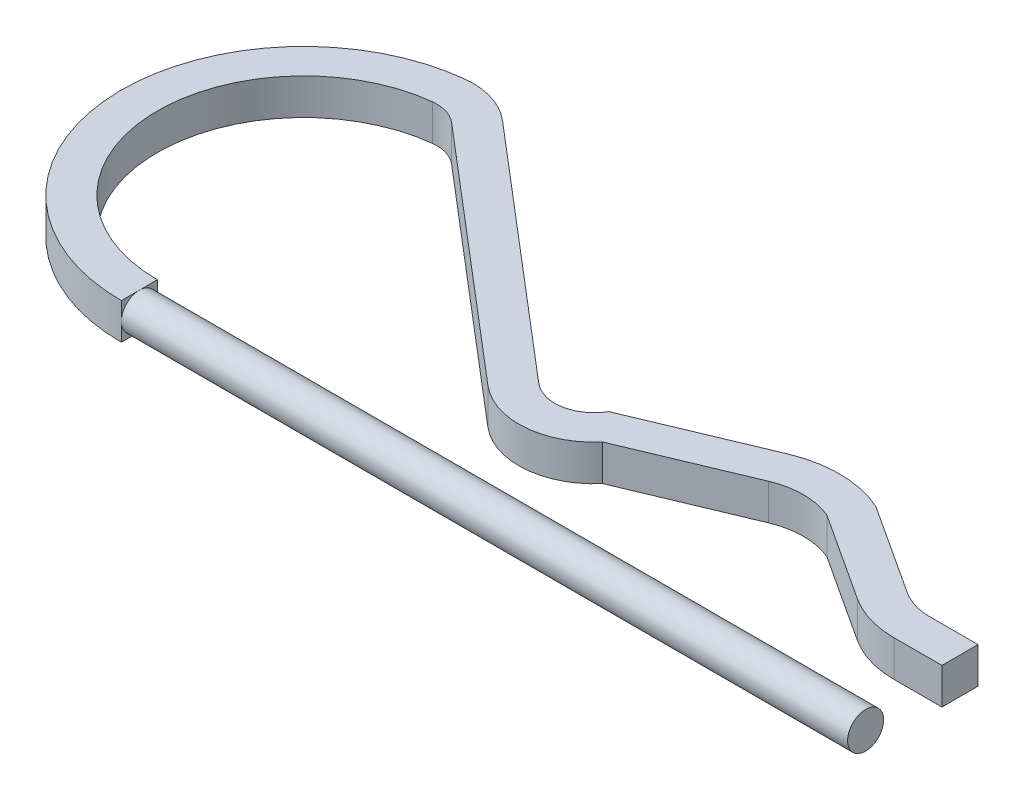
ISO-10303-21;
HEADER;
FILE_DESCRIPTION(('STEP AP214'),'2;1');
FILE_NAME('part.step','',(''),(''),'','','');
FILE_SCHEMA(('AUTOMOTIVE_DESIGN { 1 0 10303 214 1 1 1 1 }'));
ENDSEC;
DATA;
#1=APPLICATION_CONTEXT('core data for automotive mechanical design processes');
#2=APPLICATION_PROTOCOL_DEFINITION('international standard','automotive_design',2000,#1);
#3=PRODUCT_CONTEXT('',#1,'mechanical');
#4=PRODUCT('Part','Part','',(#3));
#5=PRODUCT_RELATED_PRODUCT_CATEGORY('part','',(#4));
#6=PRODUCT_DEFINITION_FORMATION('','',#4);
#7=PRODUCT_DEFINITION_CONTEXT('part definition',#1,'design');
#8=PRODUCT_DEFINITION('design','',#6,#7);
#9=PRODUCT_DEFINITION_SHAPE('','',#8);
#10=(LENGTH_UNIT() NAMED_UNIT(*) SI_UNIT(.MILLI.,.METRE.));
#11=(NAMED_UNIT(*) PLANE_ANGLE_UNIT() SI_UNIT($,.RADIAN.));
#12=(NAMED_UNIT(*) SI_UNIT($,.STERADIAN.) SOLID_ANGLE_UNIT());
#13=UNCERTAINTY_MEASURE_WITH_UNIT(LENGTH_MEASURE(1.E-05),#10,'distance_accuracy_value','');
#14=(GEOMETRIC_REPRESENTATION_CONTEXT(3) GLOBAL_UNCERTAINTY_ASSIGNED_CONTEXT((#13)) GLOBAL_UNIT_ASSIGNED_CONTEXT((#10,
#11,#12)) REPRESENTATION_CONTEXT('',''));
#15=CARTESIAN_POINT('',(0.,0.,0.));
#16=DIRECTION('',(0.,0.,1.));
#17=DIRECTION('',(1.,0.,0.));
#18=AXIS2_PLACEMENT_3D('',#15,#16,#17);
#19=CARTESIAN_POINT('',(-51.1436781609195,2.54,2.54));
#20=DIRECTION('',(-1.,0.,0.));
#21=DIRECTION('',(0.,0.,1.));
#22=AXIS2_PLACEMENT_3D('',#19,#20,#21);
#23=PLANE('',#22);
#24=CARTESIAN_POINT('',(-51.1436781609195,1.27,1.27));
#25=DIRECTION('',(1.,0.,0.));
#26=DIRECTION('',(0.,0.,-1.));
#27=AXIS2_PLACEMENT_3D('',#24,#25,#26);
#28=CIRCLE('',#27,1.27);
#29=CARTESIAN_POINT('',(-51.1436781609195,1.27,2.54));
#30=VERTEX_POINT('',#29);
#31=CARTESIAN_POINT('',(-51.1436781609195,0.,1.27));
#32=VERTEX_POINT('',#31);
#33=EDGE_CURVE('E201',#30,#32,#28,.T.);
#34=ORIENTED_EDGE('',*,*,#33,.F.);
#35=DIRECTION('',(0.,-1.,0.));
#36=VECTOR('',#35,1.);
#37=CARTESIAN_POINT('',(-51.1436781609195,2.54,2.54));
#38=LINE('',#37,#36);
#39=CARTESIAN_POINT('',(-51.1436781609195,0.,2.54));
#40=VERTEX_POINT('',#39);
#41=EDGE_CURVE('E188',#30,#40,#38,.T.);
#42=ORIENTED_EDGE('',*,*,#41,.T.);
#43=DIRECTION('',(0.,0.,-1.));
#44=VECTOR('',#43,1.);
#45=CARTESIAN_POINT('',(-51.1436781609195,0.,2.54));
#46=LINE('',#45,#44);
#47=EDGE_CURVE('E202',#40,#32,#46,.T.);
#48=ORIENTED_EDGE('',*,*,#47,.T.);
#49=EDGE_LOOP('',(#34,#42,#48));
#50=FACE_BOUND('',#49,.T.);
#51=ADVANCED_FACE('F31',(#50),#23,.F.);
#52=CARTESIAN_POINT('',(-51.1436781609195,1.27,0.));
#53=VERTEX_POINT('',#52);
#54=EDGE_CURVE('E205',#32,#53,#28,.T.);
#55=ORIENTED_EDGE('',*,*,#54,.F.);
#56=CARTESIAN_POINT('',(-51.1436781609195,0.,0.));
#57=VERTEX_POINT('',#56);
#58=EDGE_CURVE('E291',#32,#57,#46,.T.);
#59=ORIENTED_EDGE('',*,*,#58,.T.);
#60=DIRECTION('',(0.,-1.,0.));
#61=VECTOR('',#60,1.);
#62=CARTESIAN_POINT('',(-51.1436781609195,2.54,0.));
#63=LINE('',#62,#61);
#64=EDGE_CURVE('E252',#53,#57,#63,.T.);
#65=ORIENTED_EDGE('',*,*,#64,.F.);
#66=EDGE_LOOP('',(#55,#59,#65));
#67=FACE_BOUND('',#66,.T.);
#68=ADVANCED_FACE('F373',(#67),#23,.F.);
#69=CARTESIAN_POINT('',(-51.1436781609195,2.54,1.27));
#70=VERTEX_POINT('',#69);
#71=EDGE_CURVE('E46',#53,#70,#28,.T.);
#72=ORIENTED_EDGE('',*,*,#71,.F.);
#73=CARTESIAN_POINT('',(-51.1436781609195,2.54,0.));
#74=VERTEX_POINT('',#73);
#75=EDGE_CURVE('E199',#74,#53,#63,.T.);
#76=ORIENTED_EDGE('',*,*,#75,.F.);
#77=DIRECTION('',(0.,0.,-1.));
#78=VECTOR('',#77,1.);
#79=CARTESIAN_POINT('',(-51.1436781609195,2.54,2.54));
#80=LINE('',#79,#78);
#81=EDGE_CURVE('E250',#70,#74,#80,.T.);
#82=ORIENTED_EDGE('',*,*,#81,.F.);
#83=EDGE_LOOP('',(#72,#76,#82));
#84=FACE_BOUND('',#83,.T.);
#85=ADVANCED_FACE('F374',(#84),#23,.F.);
#86=EDGE_CURVE('E54',#70,#30,#28,.T.);
#87=ORIENTED_EDGE('',*,*,#86,.F.);
#88=CARTESIAN_POINT('',(-51.1436781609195,2.54,2.54));
#89=VERTEX_POINT('',#88);
#90=EDGE_CURVE('E184',#89,#70,#80,.T.);
#91=ORIENTED_EDGE('',*,*,#90,.F.);
#92=EDGE_CURVE('E180',#89,#30,#38,.T.);
#93=ORIENTED_EDGE('',*,*,#92,.T.);
#94=EDGE_LOOP('',(#87,#91,#93));
#95=FACE_BOUND('',#94,.T.);
#96=ADVANCED_FACE('F182',(#95),#23,.F.);
#97=CARTESIAN_POINT('',(-51.1436781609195,2.54,-10.3028569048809));
#98=DIRECTION('',(0.,-1.,0.));
#99=DIRECTION('',(0.,0.,-1.));
#100=AXIS2_PLACEMENT_3D('',#97,#98,#99);
#101=CYLINDRICAL_SURFACE('',#100,10.3028569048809);
#102=CARTESIAN_POINT('',(-51.1436781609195,0.,-10.3028569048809));
#103=DIRECTION('',(0.,-1.,0.));
#104=DIRECTION('',(0.,0.,-1.));
#105=AXIS2_PLACEMENT_3D('',#102,#103,#104);
#106=CIRCLE('',#105,10.3028569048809);
#107=CARTESIAN_POINT('',(-52.3081024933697,0.,-20.5397009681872));
#108=VERTEX_POINT('',#107);
#109=EDGE_CURVE('E253',#57,#108,#106,.T.);
#110=ORIENTED_EDGE('',*,*,#109,.T.);
#111=DIRECTION('',(0.,-1.,0.));
#112=VECTOR('',#111,1.);
#113=CARTESIAN_POINT('',(-52.3081024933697,2.54,-20.5397009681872));
#114=LINE('',#113,#112);
#115=CARTESIAN_POINT('',(-52.3081024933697,2.54,-20.5397009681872));
#116=VERTEX_POINT('',#115);
#117=EDGE_CURVE('E11',#116,#108,#114,.T.);
#118=ORIENTED_EDGE('',*,*,#117,.F.);
#119=CARTESIAN_POINT('',(-51.1436781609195,2.54,-10.3028569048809));
#120=DIRECTION('',(0.,-1.,0.));
#121=DIRECTION('',(0.,0.,-1.));
#122=AXIS2_PLACEMENT_3D('',#119,#120,#121);
#123=CIRCLE('',#122,10.3028569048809);
#124=EDGE_CURVE('E211',#74,#116,#123,.T.);
#125=ORIENTED_EDGE('',*,*,#124,.F.);
#126=ORIENTED_EDGE('',*,*,#75,.T.);
#127=ORIENTED_EDGE('',*,*,#64,.T.);
#128=EDGE_LOOP('',(#110,#118,#125,#126,#127));
#129=FACE_BOUND('',#128,.T.);
#130=ADVANCED_FACE('F33',(#129),#101,.F.);
#131=CARTESIAN_POINT('',(-52.0210328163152,2.54,-18.0159753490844));
#132=DIRECTION('',(0.,-1.,0.));
#133=DIRECTION('',(0.,0.,-1.));
#134=AXIS2_PLACEMENT_3D('',#131,#132,#133);
#135=CYLINDRICAL_SURFACE('',#134,2.54000000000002);
#136=CARTESIAN_POINT('',(-52.0210328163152,0.,-18.0159753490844));
#137=DIRECTION('',(0.,-1.,0.));
#138=DIRECTION('',(0.,0.,-1.));
#139=AXIS2_PLACEMENT_3D('',#136,#137,#138);
#140=CIRCLE('',#139,2.54000000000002);
#141=CARTESIAN_POINT('',(-50.3732480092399,0.,-19.9489536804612));
#142=VERTEX_POINT('',#141);
#143=EDGE_CURVE('E256',#108,#142,#140,.T.);
#144=ORIENTED_EDGE('',*,*,#143,.T.);
#145=DIRECTION('',(0.,-1.,0.));
#146=VECTOR('',#145,1.);
#147=CARTESIAN_POINT('',(-50.3732480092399,2.54,-19.9489536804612));
#148=LINE('',#147,#146);
#149=CARTESIAN_POINT('',(-50.3732480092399,2.54,-19.9489536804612));
#150=VERTEX_POINT('',#149);
#151=EDGE_CURVE('E39',#150,#142,#148,.T.);
#152=ORIENTED_EDGE('',*,*,#151,.F.);
#153=CARTESIAN_POINT('',(-52.0210328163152,2.54,-18.0159753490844));
#154=DIRECTION('',(0.,-1.,0.));
#155=DIRECTION('',(0.,0.,-1.));
#156=AXIS2_PLACEMENT_3D('',#153,#154,#155);
#157=CIRCLE('',#156,2.54000000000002);
#158=EDGE_CURVE('E214',#116,#150,#157,.T.);
#159=ORIENTED_EDGE('',*,*,#158,.F.);
#160=ORIENTED_EDGE('',*,*,#117,.T.);
#161=EDGE_LOOP('',(#144,#152,#159,#160));
#162=FACE_BOUND('',#161,.T.);
#163=ADVANCED_FACE('F368',(#162),#135,.F.);
#164=CARTESIAN_POINT('',(-50.3732480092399,2.54,-19.9489536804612));
#165=DIRECTION('',(0.648734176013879,0.,-0.761015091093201));
#166=DIRECTION('',(-0.761015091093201,0.,-0.648734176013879));
#167=AXIS2_PLACEMENT_3D('',#164,#165,#166);
#168=PLANE('',#167);
#169=DIRECTION('',(0.761015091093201,0.,0.648734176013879));
#170=VECTOR('',#169,1.);
#171=CARTESIAN_POINT('',(-50.3732480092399,0.,-19.9489536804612));
#172=LINE('',#171,#170);
#173=CARTESIAN_POINT('',(-33.0580876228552,0.,-5.18848908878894));
#174=VERTEX_POINT('',#173);
#175=EDGE_CURVE('E258',#142,#174,#172,.T.);
#176=ORIENTED_EDGE('',*,*,#175,.T.);
#177=DIRECTION('',(0.,-1.,0.));
#178=VECTOR('',#177,1.);
#179=CARTESIAN_POINT('',(-33.0580876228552,2.54,-5.18848908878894));
#180=LINE('',#179,#178);
#181=CARTESIAN_POINT('',(-33.0580876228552,2.54,-5.18848908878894));
#182=VERTEX_POINT('',#181);
#183=EDGE_CURVE('E338',#182,#174,#180,.T.);
#184=ORIENTED_EDGE('',*,*,#183,.F.);
#185=DIRECTION('',(0.761015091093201,0.,0.648734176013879));
#186=VECTOR('',#185,1.);
#187=CARTESIAN_POINT('',(-50.3732480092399,2.54,-19.9489536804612));
#188=LINE('',#187,#186);
#189=EDGE_CURVE('E216',#150,#182,#188,.T.);
#190=ORIENTED_EDGE('',*,*,#189,.F.);
#191=ORIENTED_EDGE('',*,*,#151,.T.);
#192=EDGE_LOOP('',(#176,#184,#190,#191));
#193=FACE_BOUND('',#192,.T.);
#194=ADVANCED_FACE('F345',(#193),#168,.F.);
#195=CARTESIAN_POINT('',(-29.6130882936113,2.54,-9.22973830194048));
#196=DIRECTION('',(0.,-1.,0.));
#197=DIRECTION('',(0.,0.,-1.));
#198=AXIS2_PLACEMENT_3D('',#195,#196,#197);
#199=CYLINDRICAL_SURFACE('',#198,5.31034043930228);
#200=CARTESIAN_POINT('',(-29.6130882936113,0.,-9.22973830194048));
#201=DIRECTION('',(0.,1.,0.));
#202=DIRECTION('',(0.,0.,1.));
#203=AXIS2_PLACEMENT_3D('',#200,#201,#202);
#204=CIRCLE('',#203,5.31034043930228);
#205=CARTESIAN_POINT('',(-25.5718390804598,0.,-5.78473897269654));
#206=VERTEX_POINT('',#205);
#207=EDGE_CURVE('E260',#174,#206,#204,.T.);
#208=ORIENTED_EDGE('',*,*,#207,.T.);
#209=DIRECTION('',(0.,-1.,0.));
#210=VECTOR('',#209,1.);
#211=CARTESIAN_POINT('',(-25.5718390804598,2.54,-5.78473897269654));
#212=LINE('',#211,#210);
#213=CARTESIAN_POINT('',(-25.5718390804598,2.54,-5.78473897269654));
#214=VERTEX_POINT('',#213);
#215=EDGE_CURVE('E335',#214,#206,#212,.T.);
#216=ORIENTED_EDGE('',*,*,#215,.F.);
#217=CARTESIAN_POINT('',(-29.6130882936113,2.54,-9.22973830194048));
#218=DIRECTION('',(0.,1.,0.));
#219=DIRECTION('',(0.,0.,1.));
#220=AXIS2_PLACEMENT_3D('',#217,#218,#219);
#221=CIRCLE('',#220,5.31034043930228);
#222=EDGE_CURVE('E218',#182,#214,#221,.T.);
#223=ORIENTED_EDGE('',*,*,#222,.F.);
#224=ORIENTED_EDGE('',*,*,#183,.T.);
#225=EDGE_LOOP('',(#208,#216,#223,#224));
#226=FACE_BOUND('',#225,.T.);
#227=ADVANCED_FACE('F356',(#226),#199,.T.);
#228=CARTESIAN_POINT('',(-25.5718390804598,2.54,-5.78473897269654));
#229=DIRECTION('',(-0.386228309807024,0.,-0.922403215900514));
#230=DIRECTION('',(-0.922403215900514,0.,0.386228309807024));
#231=AXIS2_PLACEMENT_3D('',#228,#229,#230);
#232=PLANE('',#231);
#233=DIRECTION('',(0.922403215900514,0.,-0.386228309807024));
#234=VECTOR('',#233,1.);
#235=CARTESIAN_POINT('',(-25.5718390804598,0.,-5.78473897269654));
#236=LINE('',#235,#234);
#237=CARTESIAN_POINT('',(-17.3443778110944,0.,-9.22973830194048));
#238=VERTEX_POINT('',#237);
#239=EDGE_CURVE('E262',#206,#238,#236,.T.);
#240=ORIENTED_EDGE('',*,*,#239,.T.);
#241=DIRECTION('',(0.,-1.,0.));
#242=VECTOR('',#241,1.);
#243=CARTESIAN_POINT('',(-17.3443778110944,2.54,-9.22973830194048));
#244=LINE('',#243,#242);
#245=CARTESIAN_POINT('',(-17.3443778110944,2.54,-9.22973830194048));
#246=VERTEX_POINT('',#245);
#247=EDGE_CURVE('E332',#246,#238,#244,.T.);
#248=ORIENTED_EDGE('',*,*,#247,.F.);
#249=DIRECTION('',(0.922403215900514,0.,-0.386228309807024));
#250=VECTOR('',#249,1.);
#251=CARTESIAN_POINT('',(-25.5718390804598,2.54,-5.78473897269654));
#252=LINE('',#251,#250);
#253=EDGE_CURVE('E220',#214,#246,#252,.T.);
#254=ORIENTED_EDGE('',*,*,#253,.F.);
#255=ORIENTED_EDGE('',*,*,#215,.T.);
#256=EDGE_LOOP('',(#240,#248,#254,#255));
#257=FACE_BOUND('',#256,.T.);
#258=ADVANCED_FACE('F360',(#257),#232,.F.);
#259=CARTESIAN_POINT('',(-15.2877333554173,2.54,-4.31799203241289));
#260=DIRECTION('',(0.,-1.,0.));
#261=DIRECTION('',(0.,0.,-1.));
#262=AXIS2_PLACEMENT_3D('',#259,#260,#261);
#263=CYLINDRICAL_SURFACE('',#262,5.32494486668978);
#264=CARTESIAN_POINT('',(-15.2877333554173,0.,-4.31799203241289));
#265=DIRECTION('',(0.,-1.,0.));
#266=DIRECTION('',(0.,0.,-1.));
#267=AXIS2_PLACEMENT_3D('',#264,#265,#266);
#268=CIRCLE('',#267,5.32494486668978);
#269=CARTESIAN_POINT('',(-13.2310888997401,0.,-9.22973830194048));
#270=VERTEX_POINT('',#269);
#271=EDGE_CURVE('E264',#238,#270,#268,.T.);
#272=ORIENTED_EDGE('',*,*,#271,.T.);
#273=DIRECTION('',(0.,-1.,0.));
#274=VECTOR('',#273,1.);
#275=CARTESIAN_POINT('',(-13.2310888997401,2.54,-9.22973830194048));
#276=LINE('',#275,#274);
#277=CARTESIAN_POINT('',(-13.2310888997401,2.54,-9.22973830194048));
#278=VERTEX_POINT('',#277);
#279=EDGE_CURVE('E329',#278,#270,#276,.T.);
#280=ORIENTED_EDGE('',*,*,#279,.F.);
#281=CARTESIAN_POINT('',(-15.2877333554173,2.54,-4.31799203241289));
#282=DIRECTION('',(0.,-1.,0.));
#283=DIRECTION('',(0.,0.,-1.));
#284=AXIS2_PLACEMENT_3D('',#281,#282,#283);
#285=CIRCLE('',#284,5.32494486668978);
#286=EDGE_CURVE('E222',#246,#278,#285,.T.);
#287=ORIENTED_EDGE('',*,*,#286,.F.);
#288=ORIENTED_EDGE('',*,*,#247,.T.);
#289=EDGE_LOOP('',(#272,#280,#287,#288));
#290=FACE_BOUND('',#289,.T.);
#291=ADVANCED_FACE('F436',(#290),#263,.F.);
#292=CARTESIAN_POINT('',(-13.2310888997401,2.54,-9.22973830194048));
#293=DIRECTION('',(0.546366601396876,0.,-0.837546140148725));
#294=DIRECTION('',(-0.837546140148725,0.,-0.546366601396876));
#295=AXIS2_PLACEMENT_3D('',#292,#293,#294);
#296=PLANE('',#295);
#297=DIRECTION('',(0.837546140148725,0.,0.546366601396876));
#298=VECTOR('',#297,1.);
#299=CARTESIAN_POINT('',(-13.2310888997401,0.,-9.22973830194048));
#300=LINE('',#299,#298);
#301=CARTESIAN_POINT('',(-7.0361043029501,0.,-5.18848908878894));
#302=VERTEX_POINT('',#301);
#303=EDGE_CURVE('E266',#270,#302,#300,.T.);
#304=ORIENTED_EDGE('',*,*,#303,.T.);
#305=DIRECTION('',(0.,-1.,0.));
#306=VECTOR('',#305,1.);
#307=CARTESIAN_POINT('',(-7.0361043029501,2.54,-5.18848908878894));
#308=LINE('',#307,#306);
#309=CARTESIAN_POINT('',(-7.0361043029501,2.54,-5.18848908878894));
#310=VERTEX_POINT('',#309);
#311=EDGE_CURVE('E326',#310,#302,#308,.T.);
#312=ORIENTED_EDGE('',*,*,#311,.F.);
#313=DIRECTION('',(0.837546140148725,0.,0.546366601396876));
#314=VECTOR('',#313,1.);
#315=CARTESIAN_POINT('',(-13.2310888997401,2.54,-9.22973830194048));
#316=LINE('',#315,#314);
#317=EDGE_CURVE('E224',#278,#310,#316,.T.);
#318=ORIENTED_EDGE('',*,*,#317,.F.);
#319=ORIENTED_EDGE('',*,*,#279,.T.);
#320=EDGE_LOOP('',(#304,#312,#318,#319));
#321=FACE_BOUND('',#320,.T.);
#322=ADVANCED_FACE('F434',(#321),#296,.F.);
#323=CARTESIAN_POINT('',(-3.3918341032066,2.54,-10.7749294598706));
#324=DIRECTION('',(0.,-1.,0.));
#325=DIRECTION('',(0.,0.,-1.));
#326=AXIS2_PLACEMENT_3D('',#323,#324,#325);
#327=CYLINDRICAL_SURFACE('',#326,6.67000909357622);
#328=CARTESIAN_POINT('',(-3.3918341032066,0.,-10.7749294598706));
#329=DIRECTION('',(0.,1.,0.));
#330=DIRECTION('',(0.,0.,1.));
#331=AXIS2_PLACEMENT_3D('',#328,#329,#330);
#332=CIRCLE('',#331,6.67000909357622);
#333=CARTESIAN_POINT('',(-3.39183410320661,0.,-4.10492036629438));
#334=VERTEX_POINT('',#333);
#335=EDGE_CURVE('E268',#302,#334,#332,.T.);
#336=ORIENTED_EDGE('',*,*,#335,.T.);
#337=DIRECTION('',(0.,-1.,0.));
#338=VECTOR('',#337,1.);
#339=CARTESIAN_POINT('',(-3.39183410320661,2.54,-4.10492036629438));
#340=LINE('',#339,#338);
#341=CARTESIAN_POINT('',(-3.39183410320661,2.54,-4.10492036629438));
#342=VERTEX_POINT('',#341);
#343=EDGE_CURVE('E323',#342,#334,#340,.T.);
#344=ORIENTED_EDGE('',*,*,#343,.F.);
#345=CARTESIAN_POINT('',(-3.3918341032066,2.54,-10.7749294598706));
#346=DIRECTION('',(0.,1.,0.));
#347=DIRECTION('',(0.,0.,1.));
#348=AXIS2_PLACEMENT_3D('',#345,#346,#347);
#349=CIRCLE('',#348,6.67000909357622);
#350=EDGE_CURVE('E226',#310,#342,#349,.T.);
#351=ORIENTED_EDGE('',*,*,#350,.F.);
#352=ORIENTED_EDGE('',*,*,#311,.T.);
#353=EDGE_LOOP('',(#336,#344,#351,#352));
#354=FACE_BOUND('',#353,.T.);
#355=ADVANCED_FACE('F430',(#354),#327,.T.);
#356=CARTESIAN_POINT('',(-3.39183410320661,2.54,-4.10492036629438));
#357=DIRECTION('',(0.,0.,-1.));
#358=DIRECTION('',(-1.,0.,0.));
#359=AXIS2_PLACEMENT_3D('',#356,#357,#358);
#360=PLANE('',#359);
#361=DIRECTION('',(1.,0.,0.));
#362=VECTOR('',#361,1.);
#363=CARTESIAN_POINT('',(-3.39183410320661,0.,-4.10492036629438));
#364=LINE('',#363,#362);
#365=CARTESIAN_POINT('',(0.,0.,-4.10492036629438));
#366=VERTEX_POINT('',#365);
#367=EDGE_CURVE('E270',#334,#366,#364,.T.);
#368=ORIENTED_EDGE('',*,*,#367,.T.);
#369=DIRECTION('',(0.,-1.,0.));
#370=VECTOR('',#369,1.);
#371=CARTESIAN_POINT('',(0.,2.54,-4.10492036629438));
#372=LINE('',#371,#370);
#373=CARTESIAN_POINT('',(0.,2.54,-4.10492036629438));
#374=VERTEX_POINT('',#373);
#375=EDGE_CURVE('E320',#374,#366,#372,.T.);
#376=ORIENTED_EDGE('',*,*,#375,.F.);
#377=DIRECTION('',(1.,0.,0.));
#378=VECTOR('',#377,1.);
#379=CARTESIAN_POINT('',(-3.39183410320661,2.54,-4.10492036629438));
#380=LINE('',#379,#378);
#381=EDGE_CURVE('E228',#342,#374,#380,.T.);
#382=ORIENTED_EDGE('',*,*,#381,.F.);
#383=ORIENTED_EDGE('',*,*,#343,.T.);
#384=EDGE_LOOP('',(#368,#376,#382,#383));
#385=FACE_BOUND('',#384,.T.);
#386=ADVANCED_FACE('F425',(#385),#360,.F.);
#387=CARTESIAN_POINT('',(0.,2.54,-6.64492036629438));
#388=DIRECTION('',(-1.,0.,0.));
#389=DIRECTION('',(0.,0.,1.));
#390=AXIS2_PLACEMENT_3D('',#387,#388,#389);
#391=PLANE('',#390);
#392=DIRECTION('',(0.,0.,-1.));
#393=VECTOR('',#392,1.);
#394=CARTESIAN_POINT('',(0.,0.,-6.64492036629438));
#395=LINE('',#394,#393);
#396=CARTESIAN_POINT('',(0.,0.,-6.64492036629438));
#397=VERTEX_POINT('',#396);
#398=EDGE_CURVE('E272',#366,#397,#395,.T.);
#399=ORIENTED_EDGE('',*,*,#398,.T.);
#400=DIRECTION('',(0.,-1.,0.));
#401=VECTOR('',#400,1.);
#402=CARTESIAN_POINT('',(0.,2.54,-6.64492036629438));
#403=LINE('',#402,#401);
#404=CARTESIAN_POINT('',(0.,2.54,-6.64492036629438));
#405=VERTEX_POINT('',#404);
#406=EDGE_CURVE('E317',#405,#397,#403,.T.);
#407=ORIENTED_EDGE('',*,*,#406,.F.);
#408=DIRECTION('',(0.,0.,-1.));
#409=VECTOR('',#408,1.);
#410=CARTESIAN_POINT('',(0.,2.54,-6.64492036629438));
#411=LINE('',#410,#409);
#412=EDGE_CURVE('E230',#374,#405,#411,.T.);
#413=ORIENTED_EDGE('',*,*,#412,.F.);
#414=ORIENTED_EDGE('',*,*,#375,.T.);
#415=EDGE_LOOP('',(#399,#407,#413,#414));
#416=FACE_BOUND('',#415,.T.);
#417=ADVANCED_FACE('F419',(#416),#391,.F.);
#418=CARTESIAN_POINT('',(-3.39183410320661,2.54,-6.64492036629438));
#419=DIRECTION('',(0.,0.,1.));
#420=DIRECTION('',(1.,0.,0.));
#421=AXIS2_PLACEMENT_3D('',#418,#419,#420);
#422=PLANE('',#421);
#423=DIRECTION('',(-1.,0.,0.));
#424=VECTOR('',#423,1.);
#425=CARTESIAN_POINT('',(-3.39183410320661,0.,-6.64492036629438));
#426=LINE('',#425,#424);
#427=CARTESIAN_POINT('',(-3.39183410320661,0.,-6.64492036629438));
#428=VERTEX_POINT('',#427);
#429=EDGE_CURVE('E274',#397,#428,#426,.T.);
#430=ORIENTED_EDGE('',*,*,#429,.T.);
#431=DIRECTION('',(0.,-1.,0.));
#432=VECTOR('',#431,1.);
#433=CARTESIAN_POINT('',(-3.39183410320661,2.54,-6.64492036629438));
#434=LINE('',#433,#432);
#435=CARTESIAN_POINT('',(-3.39183410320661,2.54,-6.64492036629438));
#436=VERTEX_POINT('',#435);
#437=EDGE_CURVE('E314',#436,#428,#434,.T.);
#438=ORIENTED_EDGE('',*,*,#437,.F.);
#439=DIRECTION('',(-1.,0.,0.));
#440=VECTOR('',#439,1.);
#441=CARTESIAN_POINT('',(-3.39183410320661,2.54,-6.64492036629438));
#442=LINE('',#441,#440);
#443=EDGE_CURVE('E232',#405,#436,#442,.T.);
#444=ORIENTED_EDGE('',*,*,#443,.F.);
#445=ORIENTED_EDGE('',*,*,#406,.T.);
#446=EDGE_LOOP('',(#430,#438,#444,#445));
#447=FACE_BOUND('',#446,.T.);
#448=ADVANCED_FACE('F415',(#447),#422,.F.);
#449=CARTESIAN_POINT('',(-3.3918341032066,2.54,-10.7749294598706));
#450=DIRECTION('',(0.,-1.,0.));
#451=DIRECTION('',(0.,0.,-1.));
#452=AXIS2_PLACEMENT_3D('',#449,#450,#451);
#453=CYLINDRICAL_SURFACE('',#452,4.13000909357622);
#454=CARTESIAN_POINT('',(-3.3918341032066,0.,-10.7749294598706));
#455=DIRECTION('',(0.,-1.,0.));
#456=DIRECTION('',(0.,0.,1.));
#457=AXIS2_PLACEMENT_3D('',#454,#455,#456);
#458=CIRCLE('',#457,4.13000909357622);
#459=CARTESIAN_POINT('',(-5.64833313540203,0.,-7.3158562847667));
#460=VERTEX_POINT('',#459);
#461=EDGE_CURVE('E276',#428,#460,#458,.T.);
#462=ORIENTED_EDGE('',*,*,#461,.T.);
#463=DIRECTION('',(0.,-1.,0.));
#464=VECTOR('',#463,1.);
#465=CARTESIAN_POINT('',(-5.64833313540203,2.54,-7.3158562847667));
#466=LINE('',#465,#464);
#467=CARTESIAN_POINT('',(-5.64833313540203,2.54,-7.3158562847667));
#468=VERTEX_POINT('',#467);
#469=EDGE_CURVE('E311',#468,#460,#466,.T.);
#470=ORIENTED_EDGE('',*,*,#469,.F.);
#471=CARTESIAN_POINT('',(-3.3918341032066,2.54,-10.7749294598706));
#472=DIRECTION('',(0.,-1.,0.));
#473=DIRECTION('',(0.,0.,1.));
#474=AXIS2_PLACEMENT_3D('',#471,#472,#473);
#475=CIRCLE('',#474,4.13000909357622);
#476=EDGE_CURVE('E234',#436,#468,#475,.T.);
#477=ORIENTED_EDGE('',*,*,#476,.F.);
#478=ORIENTED_EDGE('',*,*,#437,.T.);
#479=EDGE_LOOP('',(#462,#470,#477,#478));
#480=FACE_BOUND('',#479,.T.);
#481=ADVANCED_FACE('F410',(#480),#453,.F.);
#482=CARTESIAN_POINT('',(-12.0179453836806,2.54,-11.4710224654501));
#483=DIRECTION('',(-0.546366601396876,0.,0.837546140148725));
#484=DIRECTION('',(0.837546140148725,0.,0.546366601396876));
#485=AXIS2_PLACEMENT_3D('',#482,#483,#484);
#486=PLANE('',#485);
#487=DIRECTION('',(-0.837546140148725,0.,-0.546366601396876));
#488=VECTOR('',#487,1.);
#489=CARTESIAN_POINT('',(-12.0179453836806,0.,-11.4710224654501));
#490=LINE('',#489,#488);
#491=CARTESIAN_POINT('',(-12.0179453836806,0.,-11.4710224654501));
#492=VERTEX_POINT('',#491);
#493=EDGE_CURVE('E278',#460,#492,#490,.T.);
#494=ORIENTED_EDGE('',*,*,#493,.T.);
#495=DIRECTION('',(0.,-1.,0.));
#496=VECTOR('',#495,1.);
#497=CARTESIAN_POINT('',(-12.0179453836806,2.54,-11.4710224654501));
#498=LINE('',#497,#496);
#499=CARTESIAN_POINT('',(-12.0179453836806,2.54,-11.4710224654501));
#500=VERTEX_POINT('',#499);
#501=EDGE_CURVE('E308',#500,#492,#498,.T.);
#502=ORIENTED_EDGE('',*,*,#501,.F.);
#503=DIRECTION('',(-0.837546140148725,0.,-0.546366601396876));
#504=VECTOR('',#503,1.);
#505=CARTESIAN_POINT('',(-12.0179453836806,2.54,-11.4710224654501));
#506=LINE('',#505,#504);
#507=EDGE_CURVE('E236',#468,#500,#506,.T.);
#508=ORIENTED_EDGE('',*,*,#507,.F.);
#509=ORIENTED_EDGE('',*,*,#469,.T.);
#510=EDGE_LOOP('',(#494,#502,#508,#509));
#511=FACE_BOUND('',#510,.T.);
#512=ADVANCED_FACE('F404',(#511),#486,.F.);
#513=CARTESIAN_POINT('',(-15.2877333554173,2.54,-4.31799203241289));
#514=DIRECTION('',(0.,-1.,0.));
#515=DIRECTION('',(0.,0.,-1.));
#516=AXIS2_PLACEMENT_3D('',#513,#514,#515);
#517=CYLINDRICAL_SURFACE('',#516,7.86494486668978);
#518=CARTESIAN_POINT('',(-15.2877333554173,0.,-4.31799203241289));
#519=DIRECTION('',(0.,1.,0.));
#520=DIRECTION('',(0.,0.,-1.));
#521=AXIS2_PLACEMENT_3D('',#518,#519,#520);
#522=CIRCLE('',#521,7.86494486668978);
#523=CARTESIAN_POINT('',(-18.3253977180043,0.,-11.5726424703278));
#524=VERTEX_POINT('',#523);
#525=EDGE_CURVE('E280',#492,#524,#522,.T.);
#526=ORIENTED_EDGE('',*,*,#525,.T.);
#527=DIRECTION('',(0.,-1.,0.));
#528=VECTOR('',#527,1.);
#529=CARTESIAN_POINT('',(-18.3253977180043,2.54,-11.5726424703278));
#530=LINE('',#529,#528);
#531=CARTESIAN_POINT('',(-18.3253977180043,2.54,-11.5726424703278));
#532=VERTEX_POINT('',#531);
#533=EDGE_CURVE('E305',#532,#524,#530,.T.);
#534=ORIENTED_EDGE('',*,*,#533,.F.);
#535=CARTESIAN_POINT('',(-15.2877333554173,2.54,-4.31799203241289));
#536=DIRECTION('',(0.,1.,0.));
#537=DIRECTION('',(0.,0.,-1.));
#538=AXIS2_PLACEMENT_3D('',#535,#536,#537);
#539=CIRCLE('',#538,7.86494486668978);
#540=EDGE_CURVE('E238',#500,#532,#539,.T.);
#541=ORIENTED_EDGE('',*,*,#540,.F.);
#542=ORIENTED_EDGE('',*,*,#501,.T.);
#543=EDGE_LOOP('',(#526,#534,#541,#542));
#544=FACE_BOUND('',#543,.T.);
#545=ADVANCED_FACE('F400',(#544),#517,.T.);
#546=CARTESIAN_POINT('',(-27.2091441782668,2.54,-7.85284366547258));
#547=DIRECTION('',(0.386228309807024,0.,0.922403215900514));
#548=DIRECTION('',(0.922403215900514,0.,-0.386228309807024));
#549=AXIS2_PLACEMENT_3D('',#546,#547,#548);
#550=PLANE('',#549);
#551=DIRECTION('',(-0.922403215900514,0.,0.386228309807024));
#552=VECTOR('',#551,1.);
#553=CARTESIAN_POINT('',(-27.2091441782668,0.,-7.85284366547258));
#554=LINE('',#553,#552);
#555=CARTESIAN_POINT('',(-27.2091441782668,0.,-7.85284366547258));
#556=VERTEX_POINT('',#555);
#557=EDGE_CURVE('E282',#524,#556,#554,.T.);
#558=ORIENTED_EDGE('',*,*,#557,.T.);
#559=DIRECTION('',(0.,-1.,0.));
#560=VECTOR('',#559,1.);
#561=CARTESIAN_POINT('',(-27.2091441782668,2.54,-7.85284366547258));
#562=LINE('',#561,#560);
#563=CARTESIAN_POINT('',(-27.2091441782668,2.54,-7.85284366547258));
#564=VERTEX_POINT('',#563);
#565=EDGE_CURVE('E302',#564,#556,#562,.T.);
#566=ORIENTED_EDGE('',*,*,#565,.F.);
#567=DIRECTION('',(-0.922403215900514,0.,0.386228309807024));
#568=VECTOR('',#567,1.);
#569=CARTESIAN_POINT('',(-27.2091441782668,2.54,-7.85284366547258));
#570=LINE('',#569,#568);
#571=EDGE_CURVE('E240',#532,#564,#570,.T.);
#572=ORIENTED_EDGE('',*,*,#571,.F.);
#573=ORIENTED_EDGE('',*,*,#533,.T.);
#574=EDGE_LOOP('',(#558,#566,#572,#573));
#575=FACE_BOUND('',#574,.T.);
#576=ADVANCED_FACE('F395',(#575),#550,.F.);
#577=CARTESIAN_POINT('',(-29.6130882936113,2.54,-9.22973830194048));
#578=DIRECTION('',(0.,-1.,0.));
#579=DIRECTION('',(0.,0.,-1.));
#580=AXIS2_PLACEMENT_3D('',#577,#578,#579);
#581=CYLINDRICAL_SURFACE('',#580,2.77034043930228);
#582=CARTESIAN_POINT('',(-29.6130882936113,0.,-9.22973830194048));
#583=DIRECTION('',(0.,-1.,0.));
#584=DIRECTION('',(0.,0.,1.));
#585=AXIS2_PLACEMENT_3D('',#582,#583,#584);
#586=CIRCLE('',#585,2.77034043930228);
#587=CARTESIAN_POINT('',(-31.41030281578,0.,-7.12146742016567));
#588=VERTEX_POINT('',#587);
#589=EDGE_CURVE('E284',#556,#588,#586,.T.);
#590=ORIENTED_EDGE('',*,*,#589,.T.);
#591=DIRECTION('',(0.,-1.,0.));
#592=VECTOR('',#591,1.);
#593=CARTESIAN_POINT('',(-31.41030281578,2.54,-7.12146742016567));
#594=LINE('',#593,#592);
#595=CARTESIAN_POINT('',(-31.41030281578,2.54,-7.12146742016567));
#596=VERTEX_POINT('',#595);
#597=EDGE_CURVE('E299',#596,#588,#594,.T.);
#598=ORIENTED_EDGE('',*,*,#597,.F.);
#599=CARTESIAN_POINT('',(-29.6130882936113,2.54,-9.22973830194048));
#600=DIRECTION('',(0.,-1.,0.));
#601=DIRECTION('',(0.,0.,1.));
#602=AXIS2_PLACEMENT_3D('',#599,#600,#601);
#603=CIRCLE('',#602,2.77034043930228);
#604=EDGE_CURVE('E242',#564,#596,#603,.T.);
#605=ORIENTED_EDGE('',*,*,#604,.F.);
#606=ORIENTED_EDGE('',*,*,#565,.T.);
#607=EDGE_LOOP('',(#590,#598,#605,#606));
#608=FACE_BOUND('',#607,.T.);
#609=ADVANCED_FACE('F389',(#608),#581,.F.);
#610=CARTESIAN_POINT('',(-48.7254632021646,2.54,-21.8819320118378));
#611=DIRECTION('',(-0.648734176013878,0.,0.761015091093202));
#612=DIRECTION('',(0.761015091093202,0.,0.648734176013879));
#613=AXIS2_PLACEMENT_3D('',#610,#611,#612);
#614=PLANE('',#613);
#615=DIRECTION('',(-0.761015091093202,0.,-0.648734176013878));
#616=VECTOR('',#615,1.);
#617=CARTESIAN_POINT('',(-48.7254632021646,0.,-21.8819320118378));
#618=LINE('',#617,#616);
#619=CARTESIAN_POINT('',(-48.7254632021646,0.,-21.8819320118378));
#620=VERTEX_POINT('',#619);
#621=EDGE_CURVE('E286',#588,#620,#618,.T.);
#622=ORIENTED_EDGE('',*,*,#621,.T.);
#623=DIRECTION('',(0.,-1.,0.));
#624=VECTOR('',#623,1.);
#625=CARTESIAN_POINT('',(-48.7254632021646,2.54,-21.8819320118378));
#626=LINE('',#625,#624);
#627=CARTESIAN_POINT('',(-48.7254632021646,2.54,-21.8819320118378));
#628=VERTEX_POINT('',#627);
#629=EDGE_CURVE('E296',#628,#620,#626,.T.);
#630=ORIENTED_EDGE('',*,*,#629,.F.);
#631=DIRECTION('',(-0.761015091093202,0.,-0.648734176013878));
#632=VECTOR('',#631,1.);
#633=CARTESIAN_POINT('',(-48.7254632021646,2.54,-21.8819320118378));
#634=LINE('',#633,#632);
#635=EDGE_CURVE('E244',#596,#628,#634,.T.);
#636=ORIENTED_EDGE('',*,*,#635,.F.);
#637=ORIENTED_EDGE('',*,*,#597,.T.);
#638=EDGE_LOOP('',(#622,#630,#636,#637));
#639=FACE_BOUND('',#638,.T.);
#640=ADVANCED_FACE('F385',(#639),#614,.F.);
#641=CARTESIAN_POINT('',(-52.0210328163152,2.54,-18.0159753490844));
#642=DIRECTION('',(0.,-1.,0.));
#643=DIRECTION('',(0.,0.,-1.));
#644=AXIS2_PLACEMENT_3D('',#641,#642,#643);
#645=CYLINDRICAL_SURFACE('',#644,5.08000000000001);
#646=CARTESIAN_POINT('',(-52.0210328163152,0.,-18.0159753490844));
#647=DIRECTION('',(0.,1.,0.));
#648=DIRECTION('',(0.,0.,-1.));
#649=AXIS2_PLACEMENT_3D('',#646,#647,#648);
#650=CIRCLE('',#649,5.08000000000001);
#651=CARTESIAN_POINT('',(-52.5951721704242,0.,-23.06342658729));
#652=VERTEX_POINT('',#651);
#653=EDGE_CURVE('E288',#620,#652,#650,.T.);
#654=ORIENTED_EDGE('',*,*,#653,.T.);
#655=DIRECTION('',(0.,-1.,0.));
#656=VECTOR('',#655,1.);
#657=CARTESIAN_POINT('',(-52.5951721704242,2.54,-23.06342658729));
#658=LINE('',#657,#656);
#659=CARTESIAN_POINT('',(-52.5951721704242,2.54,-23.06342658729));
#660=VERTEX_POINT('',#659);
#661=EDGE_CURVE('E187',#660,#652,#658,.T.);
#662=ORIENTED_EDGE('',*,*,#661,.F.);
#663=CARTESIAN_POINT('',(-52.0210328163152,2.54,-18.0159753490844));
#664=DIRECTION('',(0.,1.,0.));
#665=DIRECTION('',(0.,0.,-1.));
#666=AXIS2_PLACEMENT_3D('',#663,#664,#665);
#667=CIRCLE('',#666,5.08000000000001);
#668=EDGE_CURVE('E246',#628,#660,#667,.T.);
#669=ORIENTED_EDGE('',*,*,#668,.F.);
#670=ORIENTED_EDGE('',*,*,#629,.T.);
#671=EDGE_LOOP('',(#654,#662,#669,#670));
#672=FACE_BOUND('',#671,.T.);
#673=ADVANCED_FACE('F381',(#672),#645,.T.);
#674=CARTESIAN_POINT('',(-51.1436781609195,2.54,-10.3028569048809));
#675=DIRECTION('',(0.,-1.,0.));
#676=DIRECTION('',(0.,0.,-1.));
#677=AXIS2_PLACEMENT_3D('',#674,#675,#676);
#678=CYLINDRICAL_SURFACE('',#677,12.8428569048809);
#679=CARTESIAN_POINT('',(-51.1436781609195,0.,-10.3028569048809));
#680=DIRECTION('',(0.,1.,0.));
#681=DIRECTION('',(0.,0.,-1.));
#682=AXIS2_PLACEMENT_3D('',#679,#680,#681);
#683=CIRCLE('',#682,12.8428569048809);
#684=EDGE_CURVE('E195',#652,#40,#683,.T.);
#685=ORIENTED_EDGE('',*,*,#684,.T.);
#686=ORIENTED_EDGE('',*,*,#41,.F.);
#687=ORIENTED_EDGE('',*,*,#92,.F.);
#688=CARTESIAN_POINT('',(-51.1436781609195,2.54,-10.3028569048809));
#689=DIRECTION('',(0.,1.,0.));
#690=DIRECTION('',(0.,0.,-1.));
#691=AXIS2_PLACEMENT_3D('',#688,#689,#690);
#692=CIRCLE('',#691,12.8428569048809);
#693=EDGE_CURVE('E248',#660,#89,#692,.T.);
#694=ORIENTED_EDGE('',*,*,#693,.F.);
#695=ORIENTED_EDGE('',*,*,#661,.T.);
#696=EDGE_LOOP('',(#685,#686,#687,#694,#695));
#697=FACE_BOUND('',#696,.T.);
#698=ADVANCED_FACE('F192',(#697),#678,.T.);
#699=CARTESIAN_POINT('',(-51.1436781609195,2.54,-10.3028569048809));
#700=DIRECTION('',(0.,-1.,0.));
#701=DIRECTION('',(0.,0.,-1.));
#702=AXIS2_PLACEMENT_3D('',#699,#700,#701);
#703=PLANE('',#702);
#704=ORIENTED_EDGE('',*,*,#124,.T.);
#705=ORIENTED_EDGE('',*,*,#158,.T.);
#706=ORIENTED_EDGE('',*,*,#189,.T.);
#707=ORIENTED_EDGE('',*,*,#222,.T.);
#708=ORIENTED_EDGE('',*,*,#253,.T.);
#709=ORIENTED_EDGE('',*,*,#286,.T.);
#710=ORIENTED_EDGE('',*,*,#317,.T.);
#711=ORIENTED_EDGE('',*,*,#350,.T.);
#712=ORIENTED_EDGE('',*,*,#381,.T.);
#713=ORIENTED_EDGE('',*,*,#412,.T.);
#714=ORIENTED_EDGE('',*,*,#443,.T.);
#715=ORIENTED_EDGE('',*,*,#476,.T.);
#716=ORIENTED_EDGE('',*,*,#507,.T.);
#717=ORIENTED_EDGE('',*,*,#540,.T.);
#718=ORIENTED_EDGE('',*,*,#571,.T.);
#719=ORIENTED_EDGE('',*,*,#604,.T.);
#720=ORIENTED_EDGE('',*,*,#635,.T.);
#721=ORIENTED_EDGE('',*,*,#668,.T.);
#722=ORIENTED_EDGE('',*,*,#693,.T.);
#723=ORIENTED_EDGE('',*,*,#90,.T.);
#724=ORIENTED_EDGE('',*,*,#81,.T.);
#725=EDGE_LOOP('',(#704,#705,#706,#707,#708,#709,#710,#711,#712,#713,#714,#715,#716,#717,#718,
#719,#720,#721,#722,#723,#724));
#726=FACE_BOUND('',#725,.T.);
#727=ADVANCED_FACE('F364',(#726),#703,.F.);
#728=CARTESIAN_POINT('',(-51.1436781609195,0.,-10.3028569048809));
#729=DIRECTION('',(0.,-1.,0.));
#730=DIRECTION('',(0.,0.,-1.));
#731=AXIS2_PLACEMENT_3D('',#728,#729,#730);
#732=PLANE('',#731);
#733=ORIENTED_EDGE('',*,*,#109,.F.);
#734=ORIENTED_EDGE('',*,*,#58,.F.);
#735=ORIENTED_EDGE('',*,*,#47,.F.);
#736=ORIENTED_EDGE('',*,*,#684,.F.);
#737=ORIENTED_EDGE('',*,*,#653,.F.);
#738=ORIENTED_EDGE('',*,*,#621,.F.);
#739=ORIENTED_EDGE('',*,*,#589,.F.);
#740=ORIENTED_EDGE('',*,*,#557,.F.);
#741=ORIENTED_EDGE('',*,*,#525,.F.);
#742=ORIENTED_EDGE('',*,*,#493,.F.);
#743=ORIENTED_EDGE('',*,*,#461,.F.);
#744=ORIENTED_EDGE('',*,*,#429,.F.);
#745=ORIENTED_EDGE('',*,*,#398,.F.);
#746=ORIENTED_EDGE('',*,*,#367,.F.);
#747=ORIENTED_EDGE('',*,*,#335,.F.);
#748=ORIENTED_EDGE('',*,*,#303,.F.);
#749=ORIENTED_EDGE('',*,*,#271,.F.);
#750=ORIENTED_EDGE('',*,*,#239,.F.);
#751=ORIENTED_EDGE('',*,*,#207,.F.);
#752=ORIENTED_EDGE('',*,*,#175,.F.);
#753=ORIENTED_EDGE('',*,*,#143,.F.);
#754=EDGE_LOOP('',(#733,#734,#735,#736,#737,#738,#739,#740,#741,#742,#743,#744,#745,#746,#747,
#748,#749,#750,#751,#752,#753));
#755=FACE_BOUND('',#754,.T.);
#756=ADVANCED_FACE('F351',(#755),#732,.T.);
#757=CARTESIAN_POINT('',(0.,1.27,1.27));
#758=DIRECTION('',(-1.,0.,0.));
#759=DIRECTION('',(0.,0.,1.));
#760=AXIS2_PLACEMENT_3D('',#757,#758,#759);
#761=CYLINDRICAL_SURFACE('',#760,1.27);
#762=CARTESIAN_POINT('',(0.,1.27,1.27));
#763=DIRECTION('',(1.,0.,0.));
#764=DIRECTION('',(0.,0.,-1.));
#765=AXIS2_PLACEMENT_3D('',#762,#763,#764);
#766=CIRCLE('',#765,1.27);
#767=CARTESIAN_POINT('',(0.,1.27,0.));
#768=VERTEX_POINT('',#767);
#769=EDGE_CURVE('E208',#768,#768,#766,.T.);
#770=ORIENTED_EDGE('',*,*,#769,.F.);
#771=EDGE_LOOP('',(#770));
#772=FACE_BOUND('',#771,.T.);
#773=ORIENTED_EDGE('',*,*,#71,.T.);
#774=ORIENTED_EDGE('',*,*,#86,.T.);
#775=ORIENTED_EDGE('',*,*,#33,.T.);
#776=ORIENTED_EDGE('',*,*,#54,.T.);
#777=EDGE_LOOP('',(#773,#774,#775,#776));
#778=FACE_BOUND('',#777,.T.);
#779=ADVANCED_FACE('F207',(#772,#778),#761,.T.);
#780=CARTESIAN_POINT('',(0.,1.27,1.27));
#781=DIRECTION('',(1.,0.,0.));
#782=DIRECTION('',(0.,0.,-1.));
#783=AXIS2_PLACEMENT_3D('',#780,#781,#782);
#784=PLANE('',#783);
#785=ORIENTED_EDGE('',*,*,#769,.T.);
#786=EDGE_LOOP('',(#785));
#787=FACE_BOUND('',#786,.T.);
#788=ADVANCED_FACE('F633',(#787),#784,.T.);
#789=CLOSED_SHELL('',(#51,#68,#85,#96,#130,#163,#194,#227,#258,#291,#322,#355,#386,#417,#448,
#481,#512,#545,#576,#609,#640,#673,#698,#727,#756,#779,#788));
#790=MANIFOLD_SOLID_BREP('B2',#789);
#791=ADVANCED_BREP_SHAPE_REPRESENTATION('',(#18,#790),#14);
#792=SHAPE_DEFINITION_REPRESENTATION(#9,#791);
ENDSEC;
END-ISO-10303-21;
